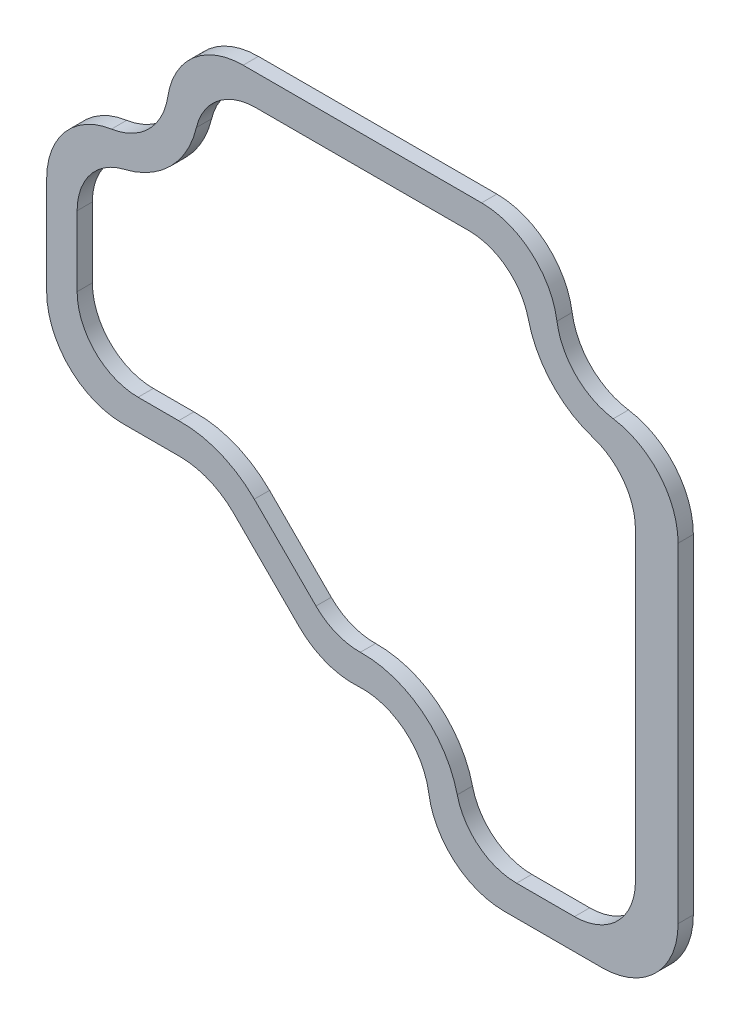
from build123d import *

# Parameters (mm, degrees)
BOSS_EXTRUDE1_DEPTH = 1.5875


with BuildPart() as part:
    # Sketch1 → Boss-Extrude1 (new body)
    with BuildSketch(Plane.XY):
        with BuildLine():
            Line((-12.421933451, 31.369), (12.421933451, 31.369))
            ThreePointArc((12.421933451, 31.369), (17.599787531, 29.447622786), (20.27090502, 24.613680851))
            ThreePointArc((20.27090502, 24.613680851), (22.238859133, 20.714859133), (26.137680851, 18.74690502))
            ThreePointArc((26.137680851, 18.74690502), (30.971622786, 16.075787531), (32.893, 10.897933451))
            Line((32.893, 10.897933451), (32.893, -23.4315))
            ThreePointArc((32.893, -23.4315), (30.568160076, -29.044160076), (24.9555, -31.369))
            Line((24.9555, -31.369), (14.756066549, -31.369))
            ThreePointArc((14.756066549, -31.369), (9.578212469, -29.447622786), (6.90709498, -24.613680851))
            ThreePointArc((6.90709498, -24.613680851), (4.381678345, -20.214227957), (-0.454720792, -18.683816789))
            ThreePointArc((-0.454720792, -18.683816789), (-3.768563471, -18.191482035), (-6.58410904, -16.375814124))
            Line((-6.58410904, -16.375814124), (-13.396083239, -9.563839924))
            ThreePointArc((-13.396083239, -9.563839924), (-15.971193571, -7.843206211), (-19.008743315, -7.239))
            Line((-19.008743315, -7.239), (-24.9555, -7.239))
            ThreePointArc((-24.9555, -7.239), (-30.568160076, -4.914160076), (-32.893, 0.6985))
            Line((-32.893, 0.6985), (-32.893, 10.897933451))
            ThreePointArc((-32.893, 10.897933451), (-30.971622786, 16.075787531), (-26.137680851, 18.74690502))
            ThreePointArc((-26.137680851, 18.74690502), (-22.238859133, 20.714859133), (-20.27090502, 24.613680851))
            ThreePointArc((-20.27090502, 24.613680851), (-17.599787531, 29.447622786), (-12.421933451, 31.369))
        make_face()
        with BuildLine():
            Line((-19.141256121, -4.064), (-23.368, -4.064))
            ThreePointArc((-23.368, -4.064), (-27.858128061, -2.204128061), (-29.718, 2.286))
            Line((-29.718, 2.286), (-29.718, 9.589629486))
            ThreePointArc((-29.718, 9.589629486), (-28.349349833, 13.52773231), (-24.833384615, 15.76823353))
            ThreePointArc((-24.833384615, 15.76823353), (-19.993795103, 18.469795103), (-17.29223353, 23.309384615))
            ThreePointArc((-17.29223353, 23.309384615), (-15.05173231, 26.825349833), (-11.113629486, 28.194))
            Line((-11.113629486, 28.194), (11.113629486, 28.194))
            ThreePointArc((11.113629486, 28.194), (15.05173231, 26.825349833), (17.29223353, 23.309384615))
            ThreePointArc((17.29223353, 23.309384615), (19.712599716, 18.762454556), (24.051846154, 15.986903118))
            ThreePointArc((24.051846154, 15.986903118), (27.232657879, 13.680979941), (28.448, 9.944967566))
            Line((28.448, 9.944967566), (28.448, -21.844))
            ThreePointArc((28.448, -21.844), (26.588128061, -26.334128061), (22.098, -28.194))
            Line((22.098, -28.194), (16.064370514, -28.194))
            ThreePointArc((16.064370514, -28.194), (12.12626769, -26.825349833), (9.88576647, -23.309384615))
            ThreePointArc((9.88576647, -23.309384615), (6.21807313, -17.619003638), (-0.210459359, -15.496180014))
            ThreePointArc((-0.210459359, -15.496180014), (-2.711140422, -15.039032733), (-4.832124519, -13.637670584))
            Line((-4.832124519, -13.637670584), (-11.261561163, -7.20823394))
            ThreePointArc((-11.261561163, -7.20823394), (-14.878034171, -4.825715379), (-19.141256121, -4.064))
        make_face(mode=Mode.SUBTRACT)
    extrude(amount=BOSS_EXTRUDE1_DEPTH)


solid = part.part
